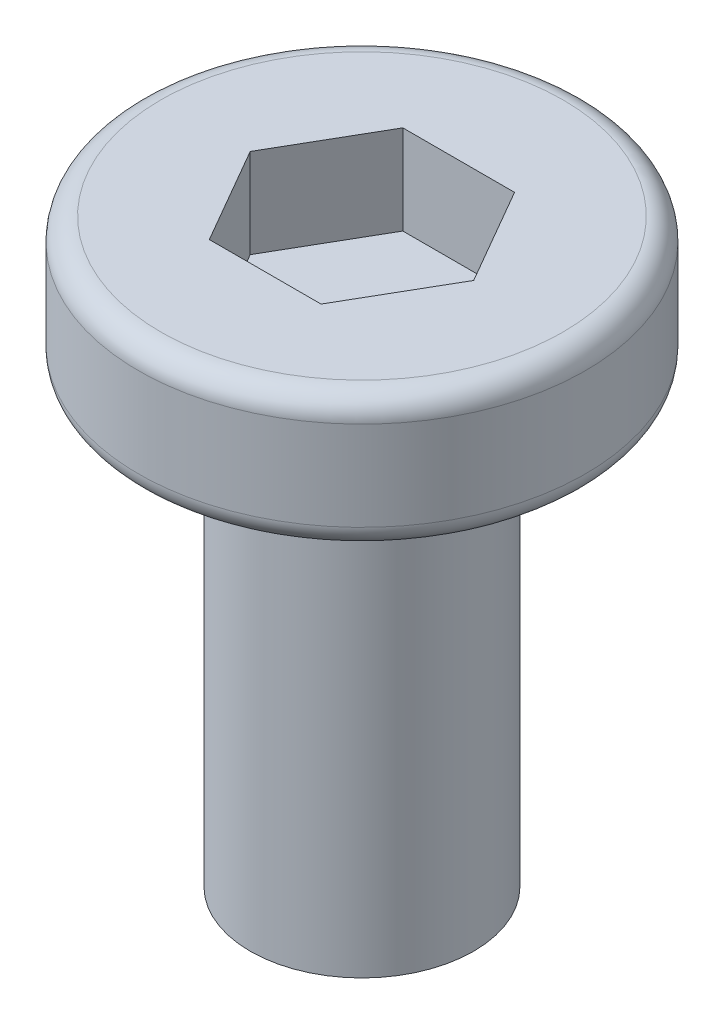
ISO-10303-21;
HEADER;
FILE_DESCRIPTION(('STEP AP214'),'2;1');
FILE_NAME('part.step','',(''),(''),'','','');
FILE_SCHEMA(('AUTOMOTIVE_DESIGN { 1 0 10303 214 1 1 1 1 }'));
ENDSEC;
DATA;
#1=APPLICATION_CONTEXT('core data for automotive mechanical design processes');
#2=APPLICATION_PROTOCOL_DEFINITION('international standard','automotive_design',2000,#1);
#3=PRODUCT_CONTEXT('',#1,'mechanical');
#4=PRODUCT('Part','Part','',(#3));
#5=PRODUCT_RELATED_PRODUCT_CATEGORY('part','',(#4));
#6=PRODUCT_DEFINITION_FORMATION('','',#4);
#7=PRODUCT_DEFINITION_CONTEXT('part definition',#1,'design');
#8=PRODUCT_DEFINITION('design','',#6,#7);
#9=PRODUCT_DEFINITION_SHAPE('','',#8);
#10=(LENGTH_UNIT() NAMED_UNIT(*) SI_UNIT(.MILLI.,.METRE.));
#11=(NAMED_UNIT(*) PLANE_ANGLE_UNIT() SI_UNIT($,.RADIAN.));
#12=(NAMED_UNIT(*) SI_UNIT($,.STERADIAN.) SOLID_ANGLE_UNIT());
#13=UNCERTAINTY_MEASURE_WITH_UNIT(LENGTH_MEASURE(1.E-05),#10,'distance_accuracy_value','');
#14=(GEOMETRIC_REPRESENTATION_CONTEXT(3) GLOBAL_UNCERTAINTY_ASSIGNED_CONTEXT((#13)) GLOBAL_UNIT_ASSIGNED_CONTEXT((#10,
#11,#12)) REPRESENTATION_CONTEXT('',''));
#15=CARTESIAN_POINT('',(0.,0.,0.));
#16=DIRECTION('',(0.,0.,1.));
#17=DIRECTION('',(1.,0.,0.));
#18=AXIS2_PLACEMENT_3D('',#15,#16,#17);
#19=CARTESIAN_POINT('',(0.,4.4,0.));
#20=DIRECTION('',(0.,1.,0.));
#21=DIRECTION('',(0.,0.,1.));
#22=AXIS2_PLACEMENT_3D('',#19,#20,#21);
#23=PLANE('',#22);
#24=DIRECTION('',(-1.,0.,0.));
#25=VECTOR('',#24,1.);
#26=CARTESIAN_POINT('',(0.5,4.4,-0.8660254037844));
#27=LINE('',#26,#25);
#28=CARTESIAN_POINT('',(0.5,4.4,-0.8660254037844));
#29=VERTEX_POINT('',#28);
#30=CARTESIAN_POINT('',(-0.5,4.4,-0.8660254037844));
#31=VERTEX_POINT('',#30);
#32=EDGE_CURVE('E209',#29,#31,#27,.T.);
#33=ORIENTED_EDGE('',*,*,#32,.T.);
#34=DIRECTION('',(-0.500000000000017,0.,0.866025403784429));
#35=VECTOR('',#34,1.);
#36=CARTESIAN_POINT('',(-0.5,4.4,-0.8660254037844));
#37=LINE('',#36,#35);
#38=CARTESIAN_POINT('',(-1.,4.4,0.));
#39=VERTEX_POINT('',#38);
#40=EDGE_CURVE('E202',#31,#39,#37,.T.);
#41=ORIENTED_EDGE('',*,*,#40,.T.);
#42=DIRECTION('',(0.500000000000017,0.,0.866025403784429));
#43=VECTOR('',#42,1.);
#44=CARTESIAN_POINT('',(-1.,4.4,0.));
#45=LINE('',#44,#43);
#46=CARTESIAN_POINT('',(-0.5,4.4,0.8660254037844));
#47=VERTEX_POINT('',#46);
#48=EDGE_CURVE('E128',#39,#47,#45,.T.);
#49=ORIENTED_EDGE('',*,*,#48,.T.);
#50=DIRECTION('',(1.,0.,0.));
#51=VECTOR('',#50,1.);
#52=CARTESIAN_POINT('',(-0.5,4.4,0.8660254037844));
#53=LINE('',#52,#51);
#54=CARTESIAN_POINT('',(0.5,4.4,0.8660254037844));
#55=VERTEX_POINT('',#54);
#56=EDGE_CURVE('E224',#47,#55,#53,.T.);
#57=ORIENTED_EDGE('',*,*,#56,.T.);
#58=DIRECTION('',(0.500000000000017,0.,-0.866025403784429));
#59=VECTOR('',#58,1.);
#60=CARTESIAN_POINT('',(0.5,4.4,0.8660254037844));
#61=LINE('',#60,#59);
#62=CARTESIAN_POINT('',(1.,4.4,0.));
#63=VERTEX_POINT('',#62);
#64=EDGE_CURVE('E219',#55,#63,#61,.T.);
#65=ORIENTED_EDGE('',*,*,#64,.T.);
#66=DIRECTION('',(-0.500000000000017,0.,-0.866025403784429));
#67=VECTOR('',#66,1.);
#68=CARTESIAN_POINT('',(1.,4.4,0.));
#69=LINE('',#68,#67);
#70=EDGE_CURVE('E214',#63,#29,#69,.T.);
#71=ORIENTED_EDGE('',*,*,#70,.T.);
#72=EDGE_LOOP('',(#33,#41,#49,#57,#65,#71));
#73=FACE_BOUND('',#72,.T.);
#74=ADVANCED_FACE('F17',(#73),#23,.T.);
#75=CARTESIAN_POINT('',(-1.,5.2,0.));
#76=DIRECTION('',(-0.866025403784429,0.,0.500000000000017));
#77=DIRECTION('',(0.500000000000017,0.,0.866025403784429));
#78=AXIS2_PLACEMENT_3D('',#75,#76,#77);
#79=PLANE('',#78);
#80=DIRECTION('',(0.,1.,0.));
#81=VECTOR('',#80,1.);
#82=CARTESIAN_POINT('',(-1.,5.2,0.));
#83=LINE('',#82,#81);
#84=CARTESIAN_POINT('',(-1.,5.2,0.));
#85=VERTEX_POINT('',#84);
#86=EDGE_CURVE('E207',#39,#85,#83,.T.);
#87=ORIENTED_EDGE('',*,*,#86,.T.);
#88=DIRECTION('',(0.500000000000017,0.,0.866025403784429));
#89=VECTOR('',#88,1.);
#90=CARTESIAN_POINT('',(-1.,5.2,0.));
#91=LINE('',#90,#89);
#92=CARTESIAN_POINT('',(-0.5,5.2,0.8660254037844));
#93=VERTEX_POINT('',#92);
#94=EDGE_CURVE('E200',#85,#93,#91,.T.);
#95=ORIENTED_EDGE('',*,*,#94,.T.);
#96=DIRECTION('',(0.,1.,0.));
#97=VECTOR('',#96,1.);
#98=CARTESIAN_POINT('',(-0.5,5.2,0.8660254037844));
#99=LINE('',#98,#97);
#100=EDGE_CURVE('E225',#93,#47,#99,.F.);
#101=ORIENTED_EDGE('',*,*,#100,.T.);
#102=ORIENTED_EDGE('',*,*,#48,.F.);
#103=EDGE_LOOP('',(#87,#95,#101,#102));
#104=FACE_BOUND('',#103,.T.);
#105=ADVANCED_FACE('F233',(#104),#79,.F.);
#106=CARTESIAN_POINT('',(-0.5,5.2,0.8660254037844));
#107=DIRECTION('',(0.,0.,1.));
#108=DIRECTION('',(1.,0.,0.));
#109=AXIS2_PLACEMENT_3D('',#106,#107,#108);
#110=PLANE('',#109);
#111=ORIENTED_EDGE('',*,*,#100,.F.);
#112=DIRECTION('',(1.,0.,0.));
#113=VECTOR('',#112,1.);
#114=CARTESIAN_POINT('',(0.,5.2,0.8660254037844));
#115=LINE('',#114,#113);
#116=CARTESIAN_POINT('',(0.5,5.2,0.8660254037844));
#117=VERTEX_POINT('',#116);
#118=EDGE_CURVE('E198',#93,#117,#115,.T.);
#119=ORIENTED_EDGE('',*,*,#118,.T.);
#120=DIRECTION('',(0.,1.,0.));
#121=VECTOR('',#120,1.);
#122=CARTESIAN_POINT('',(0.5,5.2,0.8660254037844));
#123=LINE('',#122,#121);
#124=EDGE_CURVE('E221',#117,#55,#123,.F.);
#125=ORIENTED_EDGE('',*,*,#124,.T.);
#126=ORIENTED_EDGE('',*,*,#56,.F.);
#127=EDGE_LOOP('',(#111,#119,#125,#126));
#128=FACE_BOUND('',#127,.T.);
#129=ADVANCED_FACE('F242',(#128),#110,.F.);
#130=CARTESIAN_POINT('',(0.5,5.2,0.8660254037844));
#131=DIRECTION('',(0.866025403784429,0.,0.500000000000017));
#132=DIRECTION('',(0.500000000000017,0.,-0.866025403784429));
#133=AXIS2_PLACEMENT_3D('',#130,#131,#132);
#134=PLANE('',#133);
#135=ORIENTED_EDGE('',*,*,#124,.F.);
#136=DIRECTION('',(0.500000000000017,0.,-0.866025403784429));
#137=VECTOR('',#136,1.);
#138=CARTESIAN_POINT('',(0.5,5.2,0.8660254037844));
#139=LINE('',#138,#137);
#140=CARTESIAN_POINT('',(1.,5.2,0.));
#141=VERTEX_POINT('',#140);
#142=EDGE_CURVE('E196',#117,#141,#139,.T.);
#143=ORIENTED_EDGE('',*,*,#142,.T.);
#144=DIRECTION('',(0.,1.,0.));
#145=VECTOR('',#144,1.);
#146=CARTESIAN_POINT('',(1.,5.2,0.));
#147=LINE('',#146,#145);
#148=EDGE_CURVE('E216',#141,#63,#147,.F.);
#149=ORIENTED_EDGE('',*,*,#148,.T.);
#150=ORIENTED_EDGE('',*,*,#64,.F.);
#151=EDGE_LOOP('',(#135,#143,#149,#150));
#152=FACE_BOUND('',#151,.T.);
#153=ADVANCED_FACE('F245',(#152),#134,.F.);
#154=CARTESIAN_POINT('',(1.,5.2,0.));
#155=DIRECTION('',(0.866025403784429,0.,-0.500000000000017));
#156=DIRECTION('',(-0.500000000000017,0.,-0.866025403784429));
#157=AXIS2_PLACEMENT_3D('',#154,#155,#156);
#158=PLANE('',#157);
#159=ORIENTED_EDGE('',*,*,#148,.F.);
#160=DIRECTION('',(-0.500000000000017,0.,-0.866025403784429));
#161=VECTOR('',#160,1.);
#162=CARTESIAN_POINT('',(1.,5.2,0.));
#163=LINE('',#162,#161);
#164=CARTESIAN_POINT('',(0.5,5.2,-0.8660254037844));
#165=VERTEX_POINT('',#164);
#166=EDGE_CURVE('E194',#141,#165,#163,.T.);
#167=ORIENTED_EDGE('',*,*,#166,.T.);
#168=DIRECTION('',(0.,1.,0.));
#169=VECTOR('',#168,1.);
#170=CARTESIAN_POINT('',(0.5,5.2,-0.8660254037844));
#171=LINE('',#170,#169);
#172=EDGE_CURVE('E211',#165,#29,#171,.F.);
#173=ORIENTED_EDGE('',*,*,#172,.T.);
#174=ORIENTED_EDGE('',*,*,#70,.F.);
#175=EDGE_LOOP('',(#159,#167,#173,#174));
#176=FACE_BOUND('',#175,.T.);
#177=ADVANCED_FACE('F250',(#176),#158,.F.);
#178=CARTESIAN_POINT('',(0.5,5.2,-0.8660254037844));
#179=DIRECTION('',(0.,0.,-1.));
#180=DIRECTION('',(-1.,0.,0.));
#181=AXIS2_PLACEMENT_3D('',#178,#179,#180);
#182=PLANE('',#181);
#183=ORIENTED_EDGE('',*,*,#172,.F.);
#184=DIRECTION('',(1.,0.,0.));
#185=VECTOR('',#184,1.);
#186=CARTESIAN_POINT('',(0.,5.2,-0.8660254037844));
#187=LINE('',#186,#185);
#188=CARTESIAN_POINT('',(-0.5,5.2,-0.8660254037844));
#189=VERTEX_POINT('',#188);
#190=EDGE_CURVE('E63',#165,#189,#187,.F.);
#191=ORIENTED_EDGE('',*,*,#190,.T.);
#192=DIRECTION('',(0.,1.,0.));
#193=VECTOR('',#192,1.);
#194=CARTESIAN_POINT('',(-0.5,5.2,-0.8660254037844));
#195=LINE('',#194,#193);
#196=EDGE_CURVE('E205',#189,#31,#195,.F.);
#197=ORIENTED_EDGE('',*,*,#196,.T.);
#198=ORIENTED_EDGE('',*,*,#32,.F.);
#199=EDGE_LOOP('',(#183,#191,#197,#198));
#200=FACE_BOUND('',#199,.T.);
#201=ADVANCED_FACE('F251',(#200),#182,.F.);
#202=CARTESIAN_POINT('',(-0.5,5.2,-0.8660254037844));
#203=DIRECTION('',(-0.866025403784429,0.,-0.500000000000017));
#204=DIRECTION('',(-0.500000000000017,0.,0.866025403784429));
#205=AXIS2_PLACEMENT_3D('',#202,#203,#204);
#206=PLANE('',#205);
#207=ORIENTED_EDGE('',*,*,#196,.F.);
#208=DIRECTION('',(-0.500000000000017,0.,0.866025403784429));
#209=VECTOR('',#208,1.);
#210=CARTESIAN_POINT('',(-0.5,5.2,-0.8660254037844));
#211=LINE('',#210,#209);
#212=EDGE_CURVE('E111',#189,#85,#211,.T.);
#213=ORIENTED_EDGE('',*,*,#212,.T.);
#214=ORIENTED_EDGE('',*,*,#86,.F.);
#215=ORIENTED_EDGE('',*,*,#40,.F.);
#216=EDGE_LOOP('',(#207,#213,#214,#215));
#217=FACE_BOUND('',#216,.T.);
#218=ADVANCED_FACE('F151',(#217),#206,.F.);
#219=CARTESIAN_POINT('',(0.,5.2,0.));
#220=DIRECTION('',(0.,-1.,0.));
#221=DIRECTION('',(0.,0.,-1.));
#222=AXIS2_PLACEMENT_3D('',#219,#220,#221);
#223=PLANE('',#222);
#224=CARTESIAN_POINT('',(0.,5.2,0.));
#225=DIRECTION('',(0.,-1.,0.));
#226=DIRECTION('',(0.,0.,-1.));
#227=AXIS2_PLACEMENT_3D('',#224,#225,#226);
#228=CIRCLE('',#227,1.8);
#229=CARTESIAN_POINT('',(-1.79733982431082,5.199999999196,-0.0982491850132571));
#230=VERTEX_POINT('',#229);
#231=CARTESIAN_POINT('',(1.8,5.2,0.));
#232=VERTEX_POINT('',#231);
#233=EDGE_CURVE('E108',#230,#232,#228,.T.);
#234=ORIENTED_EDGE('',*,*,#233,.F.);
#235=CARTESIAN_POINT('',(-1.8,5.2,0.));
#236=CARTESIAN_POINT('',(-1.80000096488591,5.2,-0.00409570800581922));
#237=CARTESIAN_POINT('',(-1.7999879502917,5.19999999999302,-0.00819141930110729));
#238=CARTESIAN_POINT('',(-1.79993396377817,5.19999999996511,-0.0163826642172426));
#239=CARTESIAN_POINT('',(-1.79989299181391,5.19999999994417,-0.0204781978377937));
#240=CARTESIAN_POINT('',(-1.79978309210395,5.19999999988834,-0.0286688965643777));
#241=CARTESIAN_POINT('',(-1.7997141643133,5.19999999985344,-0.0327640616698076));
#242=CARTESIAN_POINT('',(-1.79954835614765,5.19999999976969,-0.0409538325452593));
#243=CARTESIAN_POINT('',(-1.79945147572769,5.19999999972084,-0.0450484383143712));
#244=CARTESIAN_POINT('',(-1.79922976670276,5.19999999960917,-0.05323689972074));
#245=CARTESIAN_POINT('',(-1.79910493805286,5.19999999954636,-0.0573307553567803));
#246=CARTESIAN_POINT('',(-1.79882733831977,5.19999999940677,-0.0655175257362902));
#247=CARTESIAN_POINT('',(-1.79867456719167,5.19999999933,-0.0696104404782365));
#248=CARTESIAN_POINT('',(-1.79834108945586,5.1999999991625,-0.0777951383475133));
#249=CARTESIAN_POINT('',(-1.79816038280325,5.19999999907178,-0.0818869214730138));
#250=CARTESIAN_POINT('',(-1.79777104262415,5.19999999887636,-0.0900691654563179));
#251=CARTESIAN_POINT('',(-1.79756240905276,5.19999999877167,-0.0941596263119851));
#252=CARTESIAN_POINT('',(-1.79733981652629,5.19999999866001,-0.098249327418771));
#253=B_SPLINE_CURVE_WITH_KNOTS('',3,(#235,#236,#237,#238,#239,#240,#241,#242,#243,#244,#245,
#246,#247,#248,#249,#250,#251,#252),.UNSPECIFIED.,.F.,.F.,(4,2,2,2,2,2,2,2,4),(0.,
0.0122871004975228,0.0245742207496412,0.0368613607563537,0.0491485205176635,0.0614357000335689,
0.0737228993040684,0.086010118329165,0.0982973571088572),.UNSPECIFIED.);
#254=CARTESIAN_POINT('',(-1.8,5.2,0.));
#255=VERTEX_POINT('',#254);
#256=EDGE_CURVE('E51',#255,#230,#253,.T.);
#257=ORIENTED_EDGE('',*,*,#256,.F.);
#258=CARTESIAN_POINT('',(0.,5.2,0.));
#259=DIRECTION('',(0.,-1.,0.));
#260=DIRECTION('',(0.,0.,-1.));
#261=AXIS2_PLACEMENT_3D('',#258,#259,#260);
#262=CIRCLE('',#261,1.8);
#263=CARTESIAN_POINT('',(1.79732829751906,5.19999999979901,0.098247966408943));
#264=VERTEX_POINT('',#263);
#265=EDGE_CURVE('E109',#264,#255,#262,.T.);
#266=ORIENTED_EDGE('',*,*,#265,.F.);
#267=CARTESIAN_POINT('',(1.8,5.2,0.));
#268=CARTESIAN_POINT('',(1.80000048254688,5.2,0.00409567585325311));
#269=CARTESIAN_POINT('',(1.79998698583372,5.19999999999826,0.00819135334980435));
#270=CARTESIAN_POINT('',(1.7999320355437,5.19999999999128,0.0163825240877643));
#271=CARTESIAN_POINT('',(1.79989058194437,5.19999999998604,0.0204780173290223));
#272=CARTESIAN_POINT('',(1.79977971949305,5.19999999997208,0.0286686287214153));
#273=CARTESIAN_POINT('',(1.7997103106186,5.19999999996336,0.0327637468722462));
#274=CARTESIAN_POINT('',(1.79954354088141,5.19999999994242,0.0409534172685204));
#275=CARTESIAN_POINT('',(1.7994461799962,5.19999999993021,0.0450479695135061));
#276=CARTESIAN_POINT('',(1.79922351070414,5.1999999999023,0.0532363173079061));
#277=CARTESIAN_POINT('',(1.79909820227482,5.19999999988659,0.0573301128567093));
#278=CARTESIAN_POINT('',(1.79881964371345,5.1999999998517,0.0655167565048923));
#279=CARTESIAN_POINT('',(1.79866639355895,5.19999999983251,0.0696096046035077));
#280=CARTESIAN_POINT('',(1.79833195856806,5.19999999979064,0.0777941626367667));
#281=CARTESIAN_POINT('',(1.79815077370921,5.19999999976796,0.0818858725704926));
#282=CARTESIAN_POINT('',(1.79776047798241,5.1999999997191,0.0900679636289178));
#283=CARTESIAN_POINT('',(1.79755136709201,5.19999999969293,0.0941583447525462));
#284=CARTESIAN_POINT('',(1.79732829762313,5.19999999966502,0.0982479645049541));
#285=B_SPLINE_CURVE_WITH_KNOTS('',3,(#267,#268,#269,#270,#271,#272,#273,#274,#275,#276,#277,
#278,#279,#280,#281,#282,#283,#284),.UNSPECIFIED.,.F.,.F.,(4,2,2,2,2,2,2,2,4),(0.,
0.0122870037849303,0.024574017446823,0.0368610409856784,0.0491480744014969,0.0614351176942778,
0.0737221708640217,0.0860092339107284,0.0982963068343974),.UNSPECIFIED.);
#286=EDGE_CURVE('E21',#232,#264,#285,.T.);
#287=ORIENTED_EDGE('',*,*,#286,.F.);
#288=EDGE_LOOP('',(#234,#257,#266,#287));
#289=FACE_BOUND('',#288,.T.);
#290=ORIENTED_EDGE('',*,*,#190,.F.);
#291=ORIENTED_EDGE('',*,*,#166,.F.);
#292=ORIENTED_EDGE('',*,*,#142,.F.);
#293=ORIENTED_EDGE('',*,*,#118,.F.);
#294=ORIENTED_EDGE('',*,*,#94,.F.);
#295=ORIENTED_EDGE('',*,*,#212,.F.);
#296=EDGE_LOOP('',(#290,#291,#292,#293,#294,#295));
#297=FACE_BOUND('',#296,.T.);
#298=ADVANCED_FACE('F106',(#289,#297),#223,.F.);
#299=CARTESIAN_POINT('',(0.,5.,0.));
#300=DIRECTION('',(0.,-1.,0.));
#301=DIRECTION('',(0.,0.,-1.));
#302=AXIS2_PLACEMENT_3D('',#299,#300,#301);
#303=TOROIDAL_SURFACE('',#302,1.8,0.2);
#304=CARTESIAN_POINT('',(0.,5.,0.));
#305=DIRECTION('',(0.,-1.,0.));
#306=DIRECTION('',(0.,0.,-1.));
#307=AXIS2_PLACEMENT_3D('',#304,#305,#306);
#308=CIRCLE('',#307,2.);
#309=CARTESIAN_POINT('',(0.,5.,-2.));
#310=VERTEX_POINT('',#309);
#311=EDGE_CURVE('E113',#310,#310,#308,.T.);
#312=ORIENTED_EDGE('',*,*,#311,.F.);
#313=EDGE_LOOP('',(#312));
#314=FACE_BOUND('',#313,.T.);
#315=ORIENTED_EDGE('',*,*,#233,.T.);
#316=ORIENTED_EDGE('',*,*,#286,.T.);
#317=ORIENTED_EDGE('',*,*,#265,.T.);
#318=ORIENTED_EDGE('',*,*,#256,.T.);
#319=EDGE_LOOP('',(#315,#316,#317,#318));
#320=FACE_BOUND('',#319,.T.);
#321=ADVANCED_FACE('F112',(#314,#320),#303,.T.);
#322=CARTESIAN_POINT('',(0.,5.46,0.));
#323=DIRECTION('',(0.,-1.,0.));
#324=DIRECTION('',(0.,0.,-1.));
#325=AXIS2_PLACEMENT_3D('',#322,#323,#324);
#326=CYLINDRICAL_SURFACE('',#325,2.);
#327=ORIENTED_EDGE('',*,*,#311,.T.);
#328=EDGE_LOOP('',(#327));
#329=FACE_BOUND('',#328,.T.);
#330=CARTESIAN_POINT('',(0.,4.2,0.));
#331=DIRECTION('',(0.,-1.,0.));
#332=DIRECTION('',(0.,0.,-1.));
#333=AXIS2_PLACEMENT_3D('',#330,#331,#332);
#334=CIRCLE('',#333,2.);
#335=CARTESIAN_POINT('',(0.,4.2,-2.));
#336=VERTEX_POINT('',#335);
#337=EDGE_CURVE('E182',#336,#336,#334,.T.);
#338=ORIENTED_EDGE('',*,*,#337,.F.);
#339=EDGE_LOOP('',(#338));
#340=FACE_BOUND('',#339,.T.);
#341=ADVANCED_FACE('F142',(#329,#340),#326,.T.);
#342=CARTESIAN_POINT('',(0.,4.2,0.));
#343=DIRECTION('',(0.,-1.,0.));
#344=DIRECTION('',(0.,0.,-1.));
#345=AXIS2_PLACEMENT_3D('',#342,#343,#344);
#346=TOROIDAL_SURFACE('',#345,1.8,0.2);
#347=ORIENTED_EDGE('',*,*,#337,.T.);
#348=EDGE_LOOP('',(#347));
#349=FACE_BOUND('',#348,.T.);
#350=CARTESIAN_POINT('',(1.79877123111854,4.,0.0665182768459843));
#351=CARTESIAN_POINT('',(1.7863921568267,4.,0.406110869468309));
#352=CARTESIAN_POINT('',(1.6494246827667,4.,0.720823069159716));
#353=CARTESIAN_POINT('',(1.50359665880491,4.,1.05589428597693));
#354=CARTESIAN_POINT('',(1.23400333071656,4.,1.31049094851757));
#355=CARTESIAN_POINT('',(0.969454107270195,4.,1.56032409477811));
#356=CARTESIAN_POINT('',(0.623779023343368,4.,1.68848718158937));
#357=CARTESIAN_POINT('',(0.307771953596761,4.,1.8056505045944));
#358=CARTESIAN_POINT('',(-0.0332462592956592,4.,1.79971120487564));
#359=CARTESIAN_POINT('',(-0.371454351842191,4.,1.79382084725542));
#360=CARTESIAN_POINT('',(-0.68768114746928,4.,1.6634746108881));
#361=CARTESIAN_POINT('',(-1.02636386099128,4.,1.52387221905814));
#362=CARTESIAN_POINT('',(-1.28550682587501,4.,1.25996156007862));
#363=CARTESIAN_POINT('',(-1.54208977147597,4.,0.998658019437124));
#364=CARTESIAN_POINT('',(-1.67666456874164,4.,0.654833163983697));
#365=CARTESIAN_POINT('',(-1.79979948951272,4.,0.340236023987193));
#366=CARTESIAN_POINT('',(-1.8,4.,0.));
#367=B_SPLINE_CURVE_WITH_KNOTS('',2,(#350,#351,#352,#353,#354,#355,#356,#357,#358,#359,#360,
#361,#362,#363,#364,#365,#366),.UNSPECIFIED.,.F.,.F.,(3,2,2,2,2,2,2,2,3),(0.,0.125,0.25,0.375,
0.5,0.625,0.75,0.875,1.),.UNSPECIFIED.);
#368=CARTESIAN_POINT('',(1.79877086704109,4.00000000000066,0.0665182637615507));
#369=VERTEX_POINT('',#368);
#370=CARTESIAN_POINT('',(-1.8,4.,0.));
#371=VERTEX_POINT('',#370);
#372=EDGE_CURVE('E171',#369,#371,#367,.T.);
#373=ORIENTED_EDGE('',*,*,#372,.F.);
#374=CARTESIAN_POINT('',(0.,4.00000000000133,0.));
#375=DIRECTION('',(0.,-1.,0.));
#376=DIRECTION('',(0.,0.,-1.));
#377=AXIS2_PLACEMENT_3D('',#374,#375,#376);
#378=CIRCLE('',#377,1.80000072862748);
#379=CARTESIAN_POINT('',(1.80000072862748,4.00000000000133,0.));
#380=VERTEX_POINT('',#379);
#381=EDGE_CURVE('E37',#369,#380,#378,.F.);
#382=ORIENTED_EDGE('',*,*,#381,.T.);
#383=CARTESIAN_POINT('',(-1.79877197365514,4.,-0.0665178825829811));
#384=CARTESIAN_POINT('',(-1.78639064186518,4.,-0.406114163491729));
#385=CARTESIAN_POINT('',(-1.64942484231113,4.,-0.720822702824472));
#386=CARTESIAN_POINT('',(-1.50359687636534,4.,-1.05589398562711));
#387=CARTESIAN_POINT('',(-1.23400357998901,4.,-1.31049071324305));
#388=CARTESIAN_POINT('',(-0.969454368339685,4.,-1.56032394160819));
#389=CARTESIAN_POINT('',(-0.623779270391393,4.,-1.68848709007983));
#390=CARTESIAN_POINT('',(-0.307772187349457,4.,-1.8056504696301));
#391=CARTESIAN_POINT('',(0.0332460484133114,4.,-1.79971120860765));
#392=CARTESIAN_POINT('',(0.371454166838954,4.,-1.79382088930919));
#393=CARTESIAN_POINT('',(0.687680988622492,4.,-1.66347467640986));
#394=CARTESIAN_POINT('',(1.02636374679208,4.,-1.52387230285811));
#395=CARTESIAN_POINT('',(1.28550674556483,4.,-1.25996164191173));
#396=CARTESIAN_POINT('',(1.54208973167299,4.,-0.998658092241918));
#397=CARTESIAN_POINT('',(1.67666454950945,4.,-0.654833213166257));
#398=CARTESIAN_POINT('',(1.79979948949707,4.,-0.340236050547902));
#399=CARTESIAN_POINT('',(1.8,4.,0.));
#400=B_SPLINE_CURVE_WITH_KNOTS('',2,(#383,#384,#385,#386,#387,#388,#389,#390,#391,#392,#393,
#394,#395,#396,#397,#398,#399),.UNSPECIFIED.,.F.,.F.,(3,2,2,2,2,2,2,2,3),(0.,0.125,0.25,0.375,
0.5,0.625,0.75,0.875,1.),.UNSPECIFIED.);
#401=CARTESIAN_POINT('',(-1.79877123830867,4.,-0.0665180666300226));
#402=VERTEX_POINT('',#401);
#403=EDGE_CURVE('E175',#402,#380,#400,.T.);
#404=ORIENTED_EDGE('',*,*,#403,.F.);
#405=DIRECTION('',(0.018458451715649,0.,-0.999829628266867));
#406=VECTOR('',#405,1.);
#407=CARTESIAN_POINT('',(-1.8,4.,0.));
#408=LINE('',#407,#406);
#409=EDGE_CURVE('E103',#371,#402,#408,.T.);
#410=ORIENTED_EDGE('',*,*,#409,.F.);
#411=EDGE_LOOP('',(#373,#382,#404,#410));
#412=FACE_BOUND('',#411,.T.);
#413=ADVANCED_FACE('F19',(#349,#412),#346,.T.);
#414=CARTESIAN_POINT('',(0.,4.,0.));
#415=DIRECTION('',(0.,-1.,0.));
#416=DIRECTION('',(0.,0.,-1.));
#417=AXIS2_PLACEMENT_3D('',#414,#415,#416);
#418=PLANE('',#417);
#419=ORIENTED_EDGE('',*,*,#381,.F.);
#420=ORIENTED_EDGE('',*,*,#372,.T.);
#421=ORIENTED_EDGE('',*,*,#409,.T.);
#422=ORIENTED_EDGE('',*,*,#403,.T.);
#423=EDGE_LOOP('',(#419,#420,#421,#422));
#424=FACE_BOUND('',#423,.T.);
#425=CARTESIAN_POINT('',(0.,4.,0.));
#426=DIRECTION('',(0.,-1.,0.));
#427=DIRECTION('',(0.,0.,-1.));
#428=AXIS2_PLACEMENT_3D('',#425,#426,#427);
#429=CIRCLE('',#428,1.);
#430=CARTESIAN_POINT('',(0.,4.,-1.));
#431=VERTEX_POINT('',#430);
#432=EDGE_CURVE('E28',#431,#431,#429,.T.);
#433=ORIENTED_EDGE('',*,*,#432,.F.);
#434=EDGE_LOOP('',(#433));
#435=FACE_BOUND('',#434,.T.);
#436=ADVANCED_FACE('F162',(#424,#435),#418,.T.);
#437=CARTESIAN_POINT('',(0.,0.,0.));
#438=DIRECTION('',(0.,-1.,0.));
#439=DIRECTION('',(0.,0.,-1.));
#440=AXIS2_PLACEMENT_3D('',#437,#438,#439);
#441=PLANE('',#440);
#442=CARTESIAN_POINT('',(0.,0.,0.));
#443=DIRECTION('',(0.,-1.,0.));
#444=DIRECTION('',(0.,0.,-1.));
#445=AXIS2_PLACEMENT_3D('',#442,#443,#444);
#446=CIRCLE('',#445,1.);
#447=CARTESIAN_POINT('',(0.,0.,-1.));
#448=VERTEX_POINT('',#447);
#449=EDGE_CURVE('E11',#448,#448,#446,.F.);
#450=ORIENTED_EDGE('',*,*,#449,.F.);
#451=EDGE_LOOP('',(#450));
#452=FACE_BOUND('',#451,.T.);
#453=ADVANCED_FACE('F156',(#452),#441,.T.);
#454=CARTESIAN_POINT('',(0.,5.46,0.));
#455=DIRECTION('',(0.,-1.,0.));
#456=DIRECTION('',(0.,0.,-1.));
#457=AXIS2_PLACEMENT_3D('',#454,#455,#456);
#458=CYLINDRICAL_SURFACE('',#457,1.);
#459=ORIENTED_EDGE('',*,*,#449,.T.);
#460=EDGE_LOOP('',(#459));
#461=FACE_BOUND('',#460,.T.);
#462=ORIENTED_EDGE('',*,*,#432,.T.);
#463=EDGE_LOOP('',(#462));
#464=FACE_BOUND('',#463,.T.);
#465=ADVANCED_FACE('F154',(#461,#464),#458,.T.);
#466=CLOSED_SHELL('',(#74,#105,#129,#153,#177,#201,#218,#298,#321,#341,#413,#436,#453,#465));
#467=MANIFOLD_SOLID_BREP('B1',#466);
#468=ADVANCED_BREP_SHAPE_REPRESENTATION('',(#18,#467),#14);
#469=SHAPE_DEFINITION_REPRESENTATION(#9,#468);
ENDSEC;
END-ISO-10303-21;
